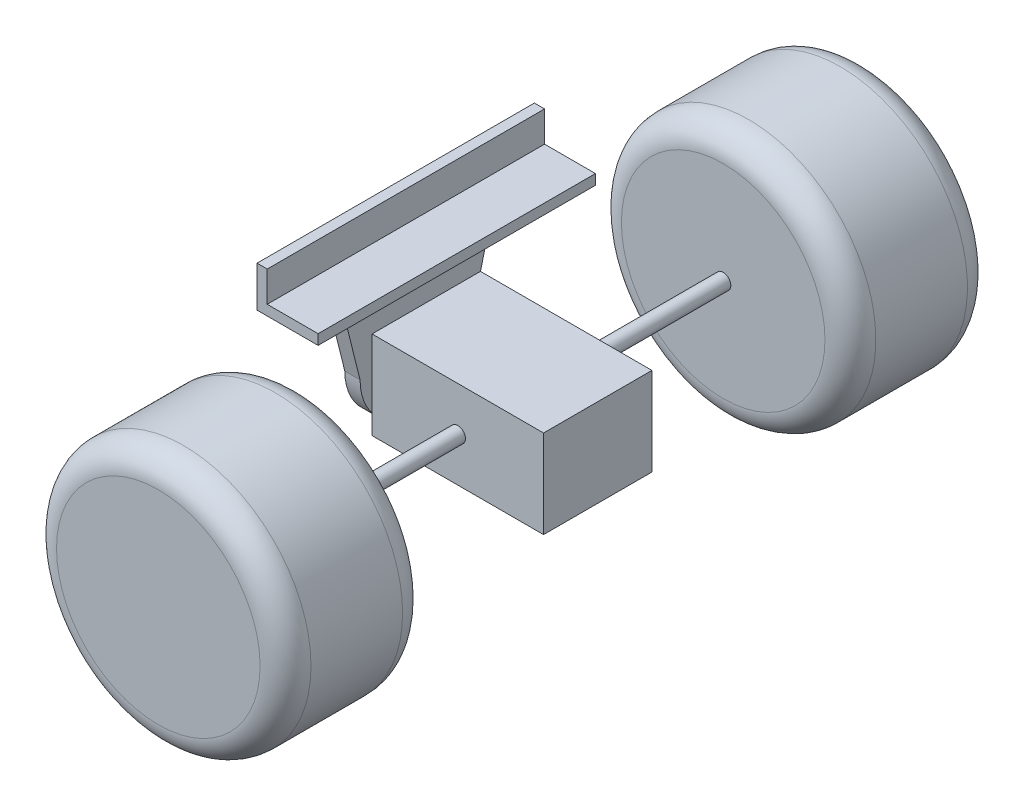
ISO-10303-21;
HEADER;
FILE_DESCRIPTION(('STEP AP214'),'2;1');
FILE_NAME('part.step','',(''),(''),'','','');
FILE_SCHEMA(('AUTOMOTIVE_DESIGN { 1 0 10303 214 1 1 1 1 }'));
ENDSEC;
DATA;
#1=APPLICATION_CONTEXT('core data for automotive mechanical design processes');
#2=APPLICATION_PROTOCOL_DEFINITION('international standard','automotive_design',2000,#1);
#3=PRODUCT_CONTEXT('',#1,'mechanical');
#4=PRODUCT('Part','Part','',(#3));
#5=PRODUCT_RELATED_PRODUCT_CATEGORY('part','',(#4));
#6=PRODUCT_DEFINITION_FORMATION('','',#4);
#7=PRODUCT_DEFINITION_CONTEXT('part definition',#1,'design');
#8=PRODUCT_DEFINITION('design','',#6,#7);
#9=PRODUCT_DEFINITION_SHAPE('','',#8);
#10=(LENGTH_UNIT() NAMED_UNIT(*) SI_UNIT(.MILLI.,.METRE.));
#11=(NAMED_UNIT(*) PLANE_ANGLE_UNIT() SI_UNIT($,.RADIAN.));
#12=(NAMED_UNIT(*) SI_UNIT($,.STERADIAN.) SOLID_ANGLE_UNIT());
#13=UNCERTAINTY_MEASURE_WITH_UNIT(LENGTH_MEASURE(1.E-05),#10,'distance_accuracy_value','');
#14=(GEOMETRIC_REPRESENTATION_CONTEXT(3) GLOBAL_UNCERTAINTY_ASSIGNED_CONTEXT((#13)) GLOBAL_UNIT_ASSIGNED_CONTEXT((#10,
#11,#12)) REPRESENTATION_CONTEXT('',''));
#15=CARTESIAN_POINT('',(0.,0.,0.));
#16=DIRECTION('',(0.,0.,1.));
#17=DIRECTION('',(1.,0.,0.));
#18=AXIS2_PLACEMENT_3D('',#15,#16,#17);
#19=CARTESIAN_POINT('',(0.,0.,41.5));
#20=DIRECTION('',(0.,0.,-1.));
#21=DIRECTION('',(-1.,0.,0.));
#22=AXIS2_PLACEMENT_3D('',#19,#20,#21);
#23=CYLINDRICAL_SURFACE('',#22,1.5);
#24=CARTESIAN_POINT('',(0.,0.,41.5));
#25=DIRECTION('',(0.,0.,1.));
#26=DIRECTION('',(1.,0.,0.));
#27=AXIS2_PLACEMENT_3D('',#24,#25,#26);
#28=CIRCLE('',#27,1.5);
#29=CARTESIAN_POINT('',(1.5,0.,41.5));
#30=VERTEX_POINT('',#29);
#31=EDGE_CURVE('E237',#30,#30,#28,.T.);
#32=ORIENTED_EDGE('',*,*,#31,.F.);
#33=EDGE_LOOP('',(#32));
#34=FACE_BOUND('',#33,.T.);
#35=CARTESIAN_POINT('',(0.,0.,10.65));
#36=DIRECTION('',(0.,0.,-1.));
#37=DIRECTION('',(-1.,0.,0.));
#38=AXIS2_PLACEMENT_3D('',#35,#36,#37);
#39=CIRCLE('',#38,1.5);
#40=CARTESIAN_POINT('',(-1.5,0.,10.65));
#41=VERTEX_POINT('',#40);
#42=EDGE_CURVE('E41',#41,#41,#39,.T.);
#43=ORIENTED_EDGE('',*,*,#42,.F.);
#44=EDGE_LOOP('',(#43));
#45=FACE_BOUND('',#44,.T.);
#46=ADVANCED_FACE('F37',(#34,#45),#23,.T.);
#47=CARTESIAN_POINT('',(0.,0.,69.5));
#48=DIRECTION('',(0.,0.,-1.));
#49=DIRECTION('',(-1.,0.,0.));
#50=AXIS2_PLACEMENT_3D('',#47,#48,#49);
#51=CYLINDRICAL_SURFACE('',#50,25.);
#52=CARTESIAN_POINT('',(0.,0.,46.5));
#53=DIRECTION('',(0.,0.,1.));
#54=DIRECTION('',(1.,0.,0.));
#55=AXIS2_PLACEMENT_3D('',#52,#53,#54);
#56=CIRCLE('',#55,25.);
#57=CARTESIAN_POINT('',(25.,0.,46.5));
#58=VERTEX_POINT('',#57);
#59=EDGE_CURVE('E246',#58,#58,#56,.T.);
#60=ORIENTED_EDGE('',*,*,#59,.T.);
#61=EDGE_LOOP('',(#60));
#62=FACE_BOUND('',#61,.T.);
#63=CARTESIAN_POINT('',(0.,0.,64.5));
#64=DIRECTION('',(0.,0.,1.));
#65=DIRECTION('',(1.,0.,0.));
#66=AXIS2_PLACEMENT_3D('',#63,#64,#65);
#67=CIRCLE('',#66,25.);
#68=CARTESIAN_POINT('',(25.,0.,64.5));
#69=VERTEX_POINT('',#68);
#70=EDGE_CURVE('E240',#69,#69,#67,.F.);
#71=ORIENTED_EDGE('',*,*,#70,.T.);
#72=EDGE_LOOP('',(#71));
#73=FACE_BOUND('',#72,.T.);
#74=ADVANCED_FACE('F298',(#62,#73),#51,.T.);
#75=CARTESIAN_POINT('',(0.,0.,69.5));
#76=DIRECTION('',(0.,0.,1.));
#77=DIRECTION('',(1.,0.,0.));
#78=AXIS2_PLACEMENT_3D('',#75,#76,#77);
#79=PLANE('',#78);
#80=CARTESIAN_POINT('',(0.,0.,69.5));
#81=DIRECTION('',(0.,0.,1.));
#82=DIRECTION('',(1.,0.,0.));
#83=AXIS2_PLACEMENT_3D('',#80,#81,#82);
#84=CIRCLE('',#83,20.);
#85=CARTESIAN_POINT('',(20.,0.,69.5));
#86=VERTEX_POINT('',#85);
#87=EDGE_CURVE('E252',#86,#86,#84,.T.);
#88=ORIENTED_EDGE('',*,*,#87,.T.);
#89=EDGE_LOOP('',(#88));
#90=FACE_BOUND('',#89,.T.);
#91=ADVANCED_FACE('F304',(#90),#79,.T.);
#92=CARTESIAN_POINT('',(0.,0.,41.5));
#93=DIRECTION('',(0.,0.,1.));
#94=DIRECTION('',(1.,0.,0.));
#95=AXIS2_PLACEMENT_3D('',#92,#93,#94);
#96=PLANE('',#95);
#97=CARTESIAN_POINT('',(0.,0.,41.5));
#98=DIRECTION('',(0.,0.,1.));
#99=DIRECTION('',(1.,0.,0.));
#100=AXIS2_PLACEMENT_3D('',#97,#98,#99);
#101=CIRCLE('',#100,20.);
#102=CARTESIAN_POINT('',(20.,0.,41.5));
#103=VERTEX_POINT('',#102);
#104=EDGE_CURVE('E249',#103,#103,#101,.F.);
#105=ORIENTED_EDGE('',*,*,#104,.T.);
#106=EDGE_LOOP('',(#105));
#107=FACE_BOUND('',#106,.T.);
#108=ORIENTED_EDGE('',*,*,#31,.T.);
#109=EDGE_LOOP('',(#108));
#110=FACE_BOUND('',#109,.T.);
#111=ADVANCED_FACE('F336',(#107,#110),#96,.F.);
#112=CARTESIAN_POINT('',(0.,0.,46.5));
#113=DIRECTION('',(0.,0.,1.));
#114=DIRECTION('',(1.,0.,0.));
#115=AXIS2_PLACEMENT_3D('',#112,#113,#114);
#116=TOROIDAL_SURFACE('',#115,20.,5.);
#117=ORIENTED_EDGE('',*,*,#104,.F.);
#118=EDGE_LOOP('',(#117));
#119=FACE_BOUND('',#118,.T.);
#120=ORIENTED_EDGE('',*,*,#59,.F.);
#121=EDGE_LOOP('',(#120));
#122=FACE_BOUND('',#121,.T.);
#123=ADVANCED_FACE('F339',(#119,#122),#116,.T.);
#124=CARTESIAN_POINT('',(0.,0.,64.5));
#125=DIRECTION('',(0.,0.,1.));
#126=DIRECTION('',(1.,0.,0.));
#127=AXIS2_PLACEMENT_3D('',#124,#125,#126);
#128=TOROIDAL_SURFACE('',#127,20.,5.);
#129=ORIENTED_EDGE('',*,*,#70,.F.);
#130=EDGE_LOOP('',(#129));
#131=FACE_BOUND('',#130,.T.);
#132=ORIENTED_EDGE('',*,*,#87,.F.);
#133=EDGE_LOOP('',(#132));
#134=FACE_BOUND('',#133,.T.);
#135=ADVANCED_FACE('F295',(#131,#134),#128,.T.);
#136=CARTESIAN_POINT('',(16.85,-8.65,10.65));
#137=DIRECTION('',(-1.,0.,0.));
#138=DIRECTION('',(0.,0.,1.));
#139=AXIS2_PLACEMENT_3D('',#136,#137,#138);
#140=PLANE('',#139);
#141=DIRECTION('',(0.,1.,0.));
#142=VECTOR('',#141,1.);
#143=CARTESIAN_POINT('',(16.85,-8.65,-10.65));
#144=LINE('',#143,#142);
#145=CARTESIAN_POINT('',(16.85,-8.65,-10.65));
#146=VERTEX_POINT('',#145);
#147=CARTESIAN_POINT('',(16.85,8.65,-10.65));
#148=VERTEX_POINT('',#147);
#149=EDGE_CURVE('E214',#146,#148,#144,.T.);
#150=ORIENTED_EDGE('',*,*,#149,.T.);
#151=DIRECTION('',(0.,0.,-1.));
#152=VECTOR('',#151,1.);
#153=CARTESIAN_POINT('',(16.85,8.65,10.65));
#154=LINE('',#153,#152);
#155=CARTESIAN_POINT('',(16.85,8.65,10.65));
#156=VERTEX_POINT('',#155);
#157=EDGE_CURVE('E234',#156,#148,#154,.T.);
#158=ORIENTED_EDGE('',*,*,#157,.F.);
#159=DIRECTION('',(0.,1.,0.));
#160=VECTOR('',#159,1.);
#161=CARTESIAN_POINT('',(16.85,-8.65,10.65));
#162=LINE('',#161,#160);
#163=CARTESIAN_POINT('',(16.85,-8.65,10.65));
#164=VERTEX_POINT('',#163);
#165=EDGE_CURVE('E216',#164,#156,#162,.T.);
#166=ORIENTED_EDGE('',*,*,#165,.F.);
#167=DIRECTION('',(0.,0.,-1.));
#168=VECTOR('',#167,1.);
#169=CARTESIAN_POINT('',(16.85,-8.65,10.65));
#170=LINE('',#169,#168);
#171=EDGE_CURVE('E222',#164,#146,#170,.T.);
#172=ORIENTED_EDGE('',*,*,#171,.T.);
#173=EDGE_LOOP('',(#150,#158,#166,#172));
#174=FACE_BOUND('',#173,.T.);
#175=ADVANCED_FACE('F281',(#174),#140,.F.);
#176=CARTESIAN_POINT('',(-16.85,8.65,10.65));
#177=DIRECTION('',(0.,-1.,0.));
#178=DIRECTION('',(0.,0.,-1.));
#179=AXIS2_PLACEMENT_3D('',#176,#177,#178);
#180=PLANE('',#179);
#181=DIRECTION('',(-1.,0.,0.));
#182=VECTOR('',#181,1.);
#183=CARTESIAN_POINT('',(-16.85,8.65,-10.65));
#184=LINE('',#183,#182);
#185=CARTESIAN_POINT('',(-16.85,8.65,-10.65));
#186=VERTEX_POINT('',#185);
#187=EDGE_CURVE('E225',#148,#186,#184,.T.);
#188=ORIENTED_EDGE('',*,*,#187,.T.);
#189=DIRECTION('',(0.,0.,-1.));
#190=VECTOR('',#189,1.);
#191=CARTESIAN_POINT('',(-16.85,8.65,10.65));
#192=LINE('',#191,#190);
#193=CARTESIAN_POINT('',(-16.85,8.65,10.65));
#194=VERTEX_POINT('',#193);
#195=EDGE_CURVE('E232',#194,#186,#192,.T.);
#196=ORIENTED_EDGE('',*,*,#195,.F.);
#197=DIRECTION('',(-1.,0.,0.));
#198=VECTOR('',#197,1.);
#199=CARTESIAN_POINT('',(-16.85,8.65,10.65));
#200=LINE('',#199,#198);
#201=EDGE_CURVE('E87',#156,#194,#200,.T.);
#202=ORIENTED_EDGE('',*,*,#201,.F.);
#203=ORIENTED_EDGE('',*,*,#157,.T.);
#204=EDGE_LOOP('',(#188,#196,#202,#203));
#205=FACE_BOUND('',#204,.T.);
#206=ADVANCED_FACE('F286',(#205),#180,.F.);
#207=CARTESIAN_POINT('',(-16.85,-8.65,10.65));
#208=DIRECTION('',(1.,0.,0.));
#209=DIRECTION('',(0.,0.,-1.));
#210=AXIS2_PLACEMENT_3D('',#207,#208,#209);
#211=PLANE('',#210);
#212=CARTESIAN_POINT('',(-16.85,0.,0.));
#213=DIRECTION('',(-1.,0.,0.));
#214=DIRECTION('',(0.,0.,1.));
#215=AXIS2_PLACEMENT_3D('',#212,#213,#214);
#216=CIRCLE('',#215,5.);
#217=CARTESIAN_POINT('',(-16.85,0.,5.));
#218=VERTEX_POINT('',#217);
#219=EDGE_CURVE('E11',#218,#218,#216,.T.);
#220=ORIENTED_EDGE('',*,*,#219,.F.);
#221=EDGE_LOOP('',(#220));
#222=FACE_BOUND('',#221,.T.);
#223=DIRECTION('',(0.,-1.,0.));
#224=VECTOR('',#223,1.);
#225=CARTESIAN_POINT('',(-16.85,-8.65,-10.65));
#226=LINE('',#225,#224);
#227=CARTESIAN_POINT('',(-16.85,-8.65,-10.65));
#228=VERTEX_POINT('',#227);
#229=EDGE_CURVE('E73',#186,#228,#226,.T.);
#230=ORIENTED_EDGE('',*,*,#229,.T.);
#231=DIRECTION('',(0.,0.,-1.));
#232=VECTOR('',#231,1.);
#233=CARTESIAN_POINT('',(-16.85,-8.65,10.65));
#234=LINE('',#233,#232);
#235=CARTESIAN_POINT('',(-16.85,-8.65,10.65));
#236=VERTEX_POINT('',#235);
#237=EDGE_CURVE('E230',#236,#228,#234,.T.);
#238=ORIENTED_EDGE('',*,*,#237,.F.);
#239=DIRECTION('',(0.,-1.,0.));
#240=VECTOR('',#239,1.);
#241=CARTESIAN_POINT('',(-16.85,-8.65,10.65));
#242=LINE('',#241,#240);
#243=EDGE_CURVE('E219',#194,#236,#242,.T.);
#244=ORIENTED_EDGE('',*,*,#243,.F.);
#245=ORIENTED_EDGE('',*,*,#195,.T.);
#246=EDGE_LOOP('',(#230,#238,#244,#245));
#247=FACE_BOUND('',#246,.T.);
#248=ADVANCED_FACE('F285',(#222,#247),#211,.F.);
#249=CARTESIAN_POINT('',(-16.85,-8.65,10.65));
#250=DIRECTION('',(0.,1.,0.));
#251=DIRECTION('',(0.,0.,1.));
#252=AXIS2_PLACEMENT_3D('',#249,#250,#251);
#253=PLANE('',#252);
#254=DIRECTION('',(1.,0.,0.));
#255=VECTOR('',#254,1.);
#256=CARTESIAN_POINT('',(-16.85,-8.65,-10.65));
#257=LINE('',#256,#255);
#258=EDGE_CURVE('E79',#228,#146,#257,.T.);
#259=ORIENTED_EDGE('',*,*,#258,.T.);
#260=ORIENTED_EDGE('',*,*,#171,.F.);
#261=DIRECTION('',(1.,0.,0.));
#262=VECTOR('',#261,1.);
#263=CARTESIAN_POINT('',(-16.85,-8.65,10.65));
#264=LINE('',#263,#262);
#265=EDGE_CURVE('E55',#236,#164,#264,.T.);
#266=ORIENTED_EDGE('',*,*,#265,.F.);
#267=ORIENTED_EDGE('',*,*,#237,.T.);
#268=EDGE_LOOP('',(#259,#260,#266,#267));
#269=FACE_BOUND('',#268,.T.);
#270=ADVANCED_FACE('F283',(#269),#253,.F.);
#271=CARTESIAN_POINT('',(0.,0.,10.65));
#272=DIRECTION('',(0.,0.,-1.));
#273=DIRECTION('',(-1.,0.,0.));
#274=AXIS2_PLACEMENT_3D('',#271,#272,#273);
#275=PLANE('',#274);
#276=ORIENTED_EDGE('',*,*,#42,.T.);
#277=EDGE_LOOP('',(#276));
#278=FACE_BOUND('',#277,.T.);
#279=ORIENTED_EDGE('',*,*,#165,.T.);
#280=ORIENTED_EDGE('',*,*,#201,.T.);
#281=ORIENTED_EDGE('',*,*,#243,.T.);
#282=ORIENTED_EDGE('',*,*,#265,.T.);
#283=EDGE_LOOP('',(#279,#280,#281,#282));
#284=FACE_BOUND('',#283,.T.);
#285=ADVANCED_FACE('F276',(#278,#284),#275,.F.);
#286=CARTESIAN_POINT('',(0.,0.,-10.65));
#287=DIRECTION('',(0.,0.,-1.));
#288=DIRECTION('',(-1.,0.,0.));
#289=AXIS2_PLACEMENT_3D('',#286,#287,#288);
#290=PLANE('',#289);
#291=CARTESIAN_POINT('',(0.,0.,-10.65));
#292=DIRECTION('',(0.,0.,-1.));
#293=DIRECTION('',(-1.,0.,0.));
#294=AXIS2_PLACEMENT_3D('',#291,#292,#293);
#295=CIRCLE('',#294,1.5);
#296=CARTESIAN_POINT('',(-1.5,0.,-10.65));
#297=VERTEX_POINT('',#296);
#298=EDGE_CURVE('E236',#297,#297,#295,.T.);
#299=ORIENTED_EDGE('',*,*,#298,.F.);
#300=EDGE_LOOP('',(#299));
#301=FACE_BOUND('',#300,.T.);
#302=ORIENTED_EDGE('',*,*,#149,.F.);
#303=ORIENTED_EDGE('',*,*,#258,.F.);
#304=ORIENTED_EDGE('',*,*,#229,.F.);
#305=ORIENTED_EDGE('',*,*,#187,.F.);
#306=EDGE_LOOP('',(#302,#303,#304,#305));
#307=FACE_BOUND('',#306,.T.);
#308=ADVANCED_FACE('F272',(#301,#307),#290,.T.);
#309=CARTESIAN_POINT('',(0.,0.,-69.5));
#310=DIRECTION('',(0.,0.,-1.));
#311=DIRECTION('',(1.,0.,0.));
#312=AXIS2_PLACEMENT_3D('',#309,#310,#311);
#313=PLANE('',#312);
#314=CARTESIAN_POINT('',(0.,0.,-69.5));
#315=DIRECTION('',(0.,0.,-1.));
#316=DIRECTION('',(-1.,0.,0.));
#317=AXIS2_PLACEMENT_3D('',#314,#315,#316);
#318=CIRCLE('',#317,20.);
#319=CARTESIAN_POINT('',(-20.,0.,-69.5));
#320=VERTEX_POINT('',#319);
#321=EDGE_CURVE('E264',#320,#320,#318,.T.);
#322=ORIENTED_EDGE('',*,*,#321,.T.);
#323=EDGE_LOOP('',(#322));
#324=FACE_BOUND('',#323,.T.);
#325=ADVANCED_FACE('F275',(#324),#313,.T.);
#326=CARTESIAN_POINT('',(0.,0.,-64.5));
#327=DIRECTION('',(0.,0.,-1.));
#328=DIRECTION('',(-1.,0.,0.));
#329=AXIS2_PLACEMENT_3D('',#326,#327,#328);
#330=TOROIDAL_SURFACE('',#329,20.,5.);
#331=ORIENTED_EDGE('',*,*,#321,.F.);
#332=EDGE_LOOP('',(#331));
#333=FACE_BOUND('',#332,.T.);
#334=CARTESIAN_POINT('',(0.,0.,-64.5));
#335=DIRECTION('',(0.,0.,-1.));
#336=DIRECTION('',(-1.,0.,0.));
#337=AXIS2_PLACEMENT_3D('',#334,#335,#336);
#338=CIRCLE('',#337,25.);
#339=CARTESIAN_POINT('',(-25.,0.,-64.5));
#340=VERTEX_POINT('',#339);
#341=EDGE_CURVE('E258',#340,#340,#338,.F.);
#342=ORIENTED_EDGE('',*,*,#341,.F.);
#343=EDGE_LOOP('',(#342));
#344=FACE_BOUND('',#343,.T.);
#345=ADVANCED_FACE('F39',(#333,#344),#330,.T.);
#346=CARTESIAN_POINT('',(0.,0.,-69.5));
#347=DIRECTION('',(0.,0.,1.));
#348=DIRECTION('',(1.,0.,0.));
#349=AXIS2_PLACEMENT_3D('',#346,#347,#348);
#350=CYLINDRICAL_SURFACE('',#349,25.);
#351=CARTESIAN_POINT('',(0.,0.,-46.5));
#352=DIRECTION('',(0.,0.,-1.));
#353=DIRECTION('',(-1.,0.,0.));
#354=AXIS2_PLACEMENT_3D('',#351,#352,#353);
#355=CIRCLE('',#354,25.);
#356=CARTESIAN_POINT('',(-25.,0.,-46.5));
#357=VERTEX_POINT('',#356);
#358=EDGE_CURVE('E261',#357,#357,#355,.T.);
#359=ORIENTED_EDGE('',*,*,#358,.T.);
#360=EDGE_LOOP('',(#359));
#361=FACE_BOUND('',#360,.T.);
#362=ORIENTED_EDGE('',*,*,#341,.T.);
#363=EDGE_LOOP('',(#362));
#364=FACE_BOUND('',#363,.T.);
#365=ADVANCED_FACE('F326',(#361,#364),#350,.T.);
#366=CARTESIAN_POINT('',(0.,0.,-46.5));
#367=DIRECTION('',(0.,0.,-1.));
#368=DIRECTION('',(-1.,0.,0.));
#369=AXIS2_PLACEMENT_3D('',#366,#367,#368);
#370=TOROIDAL_SURFACE('',#369,20.,5.);
#371=ORIENTED_EDGE('',*,*,#358,.F.);
#372=EDGE_LOOP('',(#371));
#373=FACE_BOUND('',#372,.T.);
#374=CARTESIAN_POINT('',(0.,0.,-41.5));
#375=DIRECTION('',(0.,0.,-1.));
#376=DIRECTION('',(-1.,0.,0.));
#377=AXIS2_PLACEMENT_3D('',#374,#375,#376);
#378=CIRCLE('',#377,20.);
#379=CARTESIAN_POINT('',(-20.,0.,-41.5));
#380=VERTEX_POINT('',#379);
#381=EDGE_CURVE('E255',#380,#380,#378,.F.);
#382=ORIENTED_EDGE('',*,*,#381,.F.);
#383=EDGE_LOOP('',(#382));
#384=FACE_BOUND('',#383,.T.);
#385=ADVANCED_FACE('F320',(#373,#384),#370,.T.);
#386=CARTESIAN_POINT('',(0.,0.,-41.5));
#387=DIRECTION('',(0.,0.,-1.));
#388=DIRECTION('',(1.,0.,0.));
#389=AXIS2_PLACEMENT_3D('',#386,#387,#388);
#390=PLANE('',#389);
#391=ORIENTED_EDGE('',*,*,#381,.T.);
#392=EDGE_LOOP('',(#391));
#393=FACE_BOUND('',#392,.T.);
#394=CARTESIAN_POINT('',(0.,0.,-41.5));
#395=DIRECTION('',(0.,0.,1.));
#396=DIRECTION('',(1.,0.,0.));
#397=AXIS2_PLACEMENT_3D('',#394,#395,#396);
#398=CIRCLE('',#397,1.5);
#399=CARTESIAN_POINT('',(1.5,0.,-41.5));
#400=VERTEX_POINT('',#399);
#401=EDGE_CURVE('E241',#400,#400,#398,.T.);
#402=ORIENTED_EDGE('',*,*,#401,.F.);
#403=EDGE_LOOP('',(#402));
#404=FACE_BOUND('',#403,.T.);
#405=ADVANCED_FACE('F312',(#393,#404),#390,.F.);
#406=ORIENTED_EDGE('',*,*,#298,.T.);
#407=EDGE_LOOP('',(#406));
#408=FACE_BOUND('',#407,.T.);
#409=ORIENTED_EDGE('',*,*,#401,.T.);
#410=EDGE_LOOP('',(#409));
#411=FACE_BOUND('',#410,.T.);
#412=ADVANCED_FACE('F269',(#408,#411),#23,.T.);
#413=CARTESIAN_POINT('',(-18.85,0.,0.));
#414=DIRECTION('',(1.,0.,0.));
#415=DIRECTION('',(0.,0.,-1.));
#416=AXIS2_PLACEMENT_3D('',#413,#414,#415);
#417=CYLINDRICAL_SURFACE('',#416,5.);
#418=CARTESIAN_POINT('',(-18.85,0.,0.));
#419=DIRECTION('',(-1.,0.,0.));
#420=DIRECTION('',(0.,0.,1.));
#421=AXIS2_PLACEMENT_3D('',#418,#419,#420);
#422=CIRCLE('',#421,5.);
#423=CARTESIAN_POINT('',(-18.85,0.,5.));
#424=VERTEX_POINT('',#423);
#425=EDGE_CURVE('E212',#424,#424,#422,.T.);
#426=ORIENTED_EDGE('',*,*,#425,.F.);
#427=EDGE_LOOP('',(#426));
#428=FACE_BOUND('',#427,.T.);
#429=ORIENTED_EDGE('',*,*,#219,.T.);
#430=EDGE_LOOP('',(#429));
#431=FACE_BOUND('',#430,.T.);
#432=ADVANCED_FACE('F311',(#428,#431),#417,.T.);
#433=CARTESIAN_POINT('',(-21.85,-2.58823529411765,-10.3529411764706));
#434=DIRECTION('',(0.,0.242535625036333,0.970142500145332));
#435=DIRECTION('',(0.,-0.970142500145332,0.242535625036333));
#436=AXIS2_PLACEMENT_3D('',#433,#434,#435);
#437=PLANE('',#436);
#438=DIRECTION('',(0.,-0.970142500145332,0.242535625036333));
#439=VECTOR('',#438,1.);
#440=CARTESIAN_POINT('',(-18.85,-2.58823529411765,-10.3529411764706));
#441=LINE('',#440,#439);
#442=CARTESIAN_POINT('',(-18.85,18.,-15.5));
#443=VERTEX_POINT('',#442);
#444=CARTESIAN_POINT('',(-18.85,0.,-11.));
#445=VERTEX_POINT('',#444);
#446=EDGE_CURVE('E179',#443,#445,#441,.T.);
#447=ORIENTED_EDGE('',*,*,#446,.T.);
#448=DIRECTION('',(1.,0.,0.));
#449=VECTOR('',#448,1.);
#450=CARTESIAN_POINT('',(-21.85,0.,-11.));
#451=LINE('',#450,#449);
#452=CARTESIAN_POINT('',(-21.85,0.,-11.));
#453=VERTEX_POINT('',#452);
#454=EDGE_CURVE('E206',#453,#445,#451,.T.);
#455=ORIENTED_EDGE('',*,*,#454,.F.);
#456=DIRECTION('',(0.,-0.970142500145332,0.242535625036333));
#457=VECTOR('',#456,1.);
#458=CARTESIAN_POINT('',(-21.85,-2.58823529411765,-10.3529411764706));
#459=LINE('',#458,#457);
#460=CARTESIAN_POINT('',(-21.85,18.,-15.5));
#461=VERTEX_POINT('',#460);
#462=EDGE_CURVE('E188',#461,#453,#459,.T.);
#463=ORIENTED_EDGE('',*,*,#462,.F.);
#464=DIRECTION('',(1.,0.,0.));
#465=VECTOR('',#464,1.);
#466=CARTESIAN_POINT('',(-21.85,18.,-15.5));
#467=LINE('',#466,#465);
#468=EDGE_CURVE('E209',#461,#443,#467,.T.);
#469=ORIENTED_EDGE('',*,*,#468,.T.);
#470=EDGE_LOOP('',(#447,#455,#463,#469));
#471=FACE_BOUND('',#470,.T.);
#472=ADVANCED_FACE('F317',(#471),#437,.F.);
#473=CARTESIAN_POINT('',(-21.85,0.,0.));
#474=DIRECTION('',(1.,0.,0.));
#475=DIRECTION('',(0.,0.,-1.));
#476=AXIS2_PLACEMENT_3D('',#473,#474,#475);
#477=CYLINDRICAL_SURFACE('',#476,11.);
#478=CARTESIAN_POINT('',(-18.85,0.,0.));
#479=DIRECTION('',(-1.,0.,0.));
#480=DIRECTION('',(0.,0.,1.));
#481=AXIS2_PLACEMENT_3D('',#478,#479,#480);
#482=CIRCLE('',#481,11.);
#483=CARTESIAN_POINT('',(-18.85,0.,11.));
#484=VERTEX_POINT('',#483);
#485=EDGE_CURVE('E197',#445,#484,#482,.T.);
#486=ORIENTED_EDGE('',*,*,#485,.T.);
#487=DIRECTION('',(1.,0.,0.));
#488=VECTOR('',#487,1.);
#489=CARTESIAN_POINT('',(-21.85,0.,11.));
#490=LINE('',#489,#488);
#491=CARTESIAN_POINT('',(-21.85,0.,11.));
#492=VERTEX_POINT('',#491);
#493=EDGE_CURVE('E203',#492,#484,#490,.T.);
#494=ORIENTED_EDGE('',*,*,#493,.F.);
#495=CARTESIAN_POINT('',(-21.85,0.,0.));
#496=DIRECTION('',(-1.,0.,0.));
#497=DIRECTION('',(0.,0.,1.));
#498=AXIS2_PLACEMENT_3D('',#495,#496,#497);
#499=CIRCLE('',#498,11.);
#500=EDGE_CURVE('E191',#453,#492,#499,.T.);
#501=ORIENTED_EDGE('',*,*,#500,.F.);
#502=ORIENTED_EDGE('',*,*,#454,.T.);
#503=EDGE_LOOP('',(#486,#494,#501,#502));
#504=FACE_BOUND('',#503,.T.);
#505=ADVANCED_FACE('F420',(#504),#477,.T.);
#506=CARTESIAN_POINT('',(-21.85,-2.58823529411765,10.3529411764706));
#507=DIRECTION('',(0.,0.242535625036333,-0.970142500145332));
#508=DIRECTION('',(0.,0.970142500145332,0.242535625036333));
#509=AXIS2_PLACEMENT_3D('',#506,#507,#508);
#510=PLANE('',#509);
#511=DIRECTION('',(0.,0.970142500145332,0.242535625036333));
#512=VECTOR('',#511,1.);
#513=CARTESIAN_POINT('',(-18.85,-2.58823529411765,10.3529411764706));
#514=LINE('',#513,#512);
#515=CARTESIAN_POINT('',(-18.85,18.,15.5));
#516=VERTEX_POINT('',#515);
#517=EDGE_CURVE('E189',#484,#516,#514,.T.);
#518=ORIENTED_EDGE('',*,*,#517,.T.);
#519=DIRECTION('',(1.,0.,0.));
#520=VECTOR('',#519,1.);
#521=CARTESIAN_POINT('',(-21.85,18.,15.5));
#522=LINE('',#521,#520);
#523=CARTESIAN_POINT('',(-21.85,18.,15.5));
#524=VERTEX_POINT('',#523);
#525=EDGE_CURVE('E194',#524,#516,#522,.T.);
#526=ORIENTED_EDGE('',*,*,#525,.F.);
#527=DIRECTION('',(0.,0.970142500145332,0.242535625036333));
#528=VECTOR('',#527,1.);
#529=CARTESIAN_POINT('',(-21.85,-2.58823529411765,10.3529411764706));
#530=LINE('',#529,#528);
#531=EDGE_CURVE('E193',#492,#524,#530,.T.);
#532=ORIENTED_EDGE('',*,*,#531,.F.);
#533=ORIENTED_EDGE('',*,*,#493,.T.);
#534=EDGE_LOOP('',(#518,#526,#532,#533));
#535=FACE_BOUND('',#534,.T.);
#536=ADVANCED_FACE('F425',(#535),#510,.F.);
#537=CARTESIAN_POINT('',(-21.85,0.,0.));
#538=DIRECTION('',(-1.,0.,0.));
#539=DIRECTION('',(0.,0.,1.));
#540=AXIS2_PLACEMENT_3D('',#537,#538,#539);
#541=PLANE('',#540);
#542=DIRECTION('',(0.,0.,-1.));
#543=VECTOR('',#542,1.);
#544=CARTESIAN_POINT('',(-21.85,18.,0.));
#545=LINE('',#544,#543);
#546=EDGE_CURVE('E185',#524,#461,#545,.T.);
#547=ORIENTED_EDGE('',*,*,#546,.T.);
#548=ORIENTED_EDGE('',*,*,#462,.T.);
#549=ORIENTED_EDGE('',*,*,#500,.T.);
#550=ORIENTED_EDGE('',*,*,#531,.T.);
#551=EDGE_LOOP('',(#547,#548,#549,#550));
#552=FACE_BOUND('',#551,.T.);
#553=ADVANCED_FACE('F442',(#552),#541,.T.);
#554=CARTESIAN_POINT('',(-18.85,0.,0.));
#555=DIRECTION('',(-1.,0.,0.));
#556=DIRECTION('',(0.,0.,1.));
#557=AXIS2_PLACEMENT_3D('',#554,#555,#556);
#558=PLANE('',#557);
#559=ORIENTED_EDGE('',*,*,#425,.T.);
#560=EDGE_LOOP('',(#559));
#561=FACE_BOUND('',#560,.T.);
#562=DIRECTION('',(0.,0.,-1.));
#563=VECTOR('',#562,1.);
#564=CARTESIAN_POINT('',(-18.85,18.,0.));
#565=LINE('',#564,#563);
#566=EDGE_CURVE('E176',#516,#443,#565,.T.);
#567=ORIENTED_EDGE('',*,*,#566,.F.);
#568=ORIENTED_EDGE('',*,*,#517,.F.);
#569=ORIENTED_EDGE('',*,*,#485,.F.);
#570=ORIENTED_EDGE('',*,*,#446,.F.);
#571=EDGE_LOOP('',(#567,#568,#569,#570));
#572=FACE_BOUND('',#571,.T.);
#573=ADVANCED_FACE('F453',(#561,#572),#558,.F.);
#574=CARTESIAN_POINT('',(0.,18.,27.25));
#575=DIRECTION('',(0.,1.,0.));
#576=DIRECTION('',(0.,0.,1.));
#577=AXIS2_PLACEMENT_3D('',#574,#575,#576);
#578=PLANE('',#577);
#579=DIRECTION('',(1.,0.,0.));
#580=VECTOR('',#579,1.);
#581=CARTESIAN_POINT('',(0.,18.,-27.25));
#582=LINE('',#581,#580);
#583=CARTESIAN_POINT('',(-22.85,18.,-27.25));
#584=VERTEX_POINT('',#583);
#585=CARTESIAN_POINT('',(-10.85,18.,-27.25));
#586=VERTEX_POINT('',#585);
#587=EDGE_CURVE('E175',#584,#586,#582,.T.);
#588=ORIENTED_EDGE('',*,*,#587,.T.);
#589=DIRECTION('',(0.,0.,-1.));
#590=VECTOR('',#589,1.);
#591=CARTESIAN_POINT('',(-10.85,18.,27.25));
#592=LINE('',#591,#590);
#593=CARTESIAN_POINT('',(-10.85,18.,27.25));
#594=VERTEX_POINT('',#593);
#595=EDGE_CURVE('E155',#594,#586,#592,.T.);
#596=ORIENTED_EDGE('',*,*,#595,.F.);
#597=DIRECTION('',(1.,0.,0.));
#598=VECTOR('',#597,1.);
#599=CARTESIAN_POINT('',(0.,18.,27.25));
#600=LINE('',#599,#598);
#601=CARTESIAN_POINT('',(-22.85,18.,27.25));
#602=VERTEX_POINT('',#601);
#603=EDGE_CURVE('E162',#602,#594,#600,.T.);
#604=ORIENTED_EDGE('',*,*,#603,.F.);
#605=DIRECTION('',(0.,0.,-1.));
#606=VECTOR('',#605,1.);
#607=CARTESIAN_POINT('',(-22.85,18.,27.25));
#608=LINE('',#607,#606);
#609=EDGE_CURVE('E555',#602,#584,#608,.T.);
#610=ORIENTED_EDGE('',*,*,#609,.T.);
#611=EDGE_LOOP('',(#588,#596,#604,#610));
#612=FACE_BOUND('',#611,.T.);
#613=ORIENTED_EDGE('',*,*,#525,.T.);
#614=ORIENTED_EDGE('',*,*,#566,.T.);
#615=ORIENTED_EDGE('',*,*,#468,.F.);
#616=ORIENTED_EDGE('',*,*,#546,.F.);
#617=EDGE_LOOP('',(#613,#614,#615,#616));
#618=FACE_BOUND('',#617,.T.);
#619=ADVANCED_FACE('F172',(#612,#618),#578,.F.);
#620=CARTESIAN_POINT('',(-10.85,0.,27.25));
#621=DIRECTION('',(-1.,0.,0.));
#622=DIRECTION('',(0.,0.,1.));
#623=AXIS2_PLACEMENT_3D('',#620,#621,#622);
#624=PLANE('',#623);
#625=DIRECTION('',(0.,1.,0.));
#626=VECTOR('',#625,1.);
#627=CARTESIAN_POINT('',(-10.85,0.,-27.25));
#628=LINE('',#627,#626);
#629=CARTESIAN_POINT('',(-10.85,20.,-27.25));
#630=VERTEX_POINT('',#629);
#631=EDGE_CURVE('E553',#586,#630,#628,.T.);
#632=ORIENTED_EDGE('',*,*,#631,.T.);
#633=DIRECTION('',(0.,0.,-1.));
#634=VECTOR('',#633,1.);
#635=CARTESIAN_POINT('',(-10.85,20.,27.25));
#636=LINE('',#635,#634);
#637=CARTESIAN_POINT('',(-10.85,20.,27.25));
#638=VERTEX_POINT('',#637);
#639=EDGE_CURVE('E157',#638,#630,#636,.T.);
#640=ORIENTED_EDGE('',*,*,#639,.F.);
#641=DIRECTION('',(0.,1.,0.));
#642=VECTOR('',#641,1.);
#643=CARTESIAN_POINT('',(-10.85,0.,27.25));
#644=LINE('',#643,#642);
#645=EDGE_CURVE('E150',#594,#638,#644,.T.);
#646=ORIENTED_EDGE('',*,*,#645,.F.);
#647=ORIENTED_EDGE('',*,*,#595,.T.);
#648=EDGE_LOOP('',(#632,#640,#646,#647));
#649=FACE_BOUND('',#648,.T.);
#650=ADVANCED_FACE('F153',(#649),#624,.F.);
#651=CARTESIAN_POINT('',(0.,20.,27.25));
#652=DIRECTION('',(0.,1.,0.));
#653=DIRECTION('',(0.,0.,1.));
#654=AXIS2_PLACEMENT_3D('',#651,#652,#653);
#655=PLANE('',#654);
#656=DIRECTION('',(1.,0.,0.));
#657=VECTOR('',#656,1.);
#658=CARTESIAN_POINT('',(0.,20.,-27.25));
#659=LINE('',#658,#657);
#660=CARTESIAN_POINT('',(-20.85,20.,-27.25));
#661=VERTEX_POINT('',#660);
#662=EDGE_CURVE('E574',#661,#630,#659,.T.);
#663=ORIENTED_EDGE('',*,*,#662,.F.);
#664=DIRECTION('',(0.,0.,-1.));
#665=VECTOR('',#664,1.);
#666=CARTESIAN_POINT('',(-20.85,20.,27.25));
#667=LINE('',#666,#665);
#668=CARTESIAN_POINT('',(-20.85,20.,27.25));
#669=VERTEX_POINT('',#668);
#670=EDGE_CURVE('E181',#669,#661,#667,.T.);
#671=ORIENTED_EDGE('',*,*,#670,.F.);
#672=DIRECTION('',(1.,0.,0.));
#673=VECTOR('',#672,1.);
#674=CARTESIAN_POINT('',(0.,20.,27.25));
#675=LINE('',#674,#673);
#676=EDGE_CURVE('E161',#669,#638,#675,.T.);
#677=ORIENTED_EDGE('',*,*,#676,.T.);
#678=ORIENTED_EDGE('',*,*,#639,.T.);
#679=EDGE_LOOP('',(#663,#671,#677,#678));
#680=FACE_BOUND('',#679,.T.);
#681=ADVANCED_FACE('F484',(#680),#655,.T.);
#682=CARTESIAN_POINT('',(-20.85,0.,27.25));
#683=DIRECTION('',(-1.,0.,0.));
#684=DIRECTION('',(0.,0.,1.));
#685=AXIS2_PLACEMENT_3D('',#682,#683,#684);
#686=PLANE('',#685);
#687=DIRECTION('',(0.,1.,0.));
#688=VECTOR('',#687,1.);
#689=CARTESIAN_POINT('',(-20.85,0.,-27.25));
#690=LINE('',#689,#688);
#691=CARTESIAN_POINT('',(-20.85,26.,-27.25));
#692=VERTEX_POINT('',#691);
#693=EDGE_CURVE('E561',#661,#692,#690,.T.);
#694=ORIENTED_EDGE('',*,*,#693,.T.);
#695=DIRECTION('',(0.,0.,-1.));
#696=VECTOR('',#695,1.);
#697=CARTESIAN_POINT('',(-20.85,26.,27.25));
#698=LINE('',#697,#696);
#699=CARTESIAN_POINT('',(-20.85,26.,27.25));
#700=VERTEX_POINT('',#699);
#701=EDGE_CURVE('E567',#700,#692,#698,.T.);
#702=ORIENTED_EDGE('',*,*,#701,.F.);
#703=DIRECTION('',(0.,1.,0.));
#704=VECTOR('',#703,1.);
#705=CARTESIAN_POINT('',(-20.85,0.,27.25));
#706=LINE('',#705,#704);
#707=EDGE_CURVE('E572',#669,#700,#706,.T.);
#708=ORIENTED_EDGE('',*,*,#707,.F.);
#709=ORIENTED_EDGE('',*,*,#670,.T.);
#710=EDGE_LOOP('',(#694,#702,#708,#709));
#711=FACE_BOUND('',#710,.T.);
#712=ADVANCED_FACE('F493',(#711),#686,.F.);
#713=CARTESIAN_POINT('',(0.,26.,27.25));
#714=DIRECTION('',(0.,-1.,0.));
#715=DIRECTION('',(0.,0.,-1.));
#716=AXIS2_PLACEMENT_3D('',#713,#714,#715);
#717=PLANE('',#716);
#718=DIRECTION('',(-1.,0.,0.));
#719=VECTOR('',#718,1.);
#720=CARTESIAN_POINT('',(0.,26.,-27.25));
#721=LINE('',#720,#719);
#722=CARTESIAN_POINT('',(-22.85,26.,-27.25));
#723=VERTEX_POINT('',#722);
#724=EDGE_CURVE('E559',#692,#723,#721,.T.);
#725=ORIENTED_EDGE('',*,*,#724,.T.);
#726=DIRECTION('',(0.,0.,-1.));
#727=VECTOR('',#726,1.);
#728=CARTESIAN_POINT('',(-22.85,26.,27.25));
#729=LINE('',#728,#727);
#730=CARTESIAN_POINT('',(-22.85,26.,27.25));
#731=VERTEX_POINT('',#730);
#732=EDGE_CURVE('E557',#731,#723,#729,.T.);
#733=ORIENTED_EDGE('',*,*,#732,.F.);
#734=DIRECTION('',(-1.,0.,0.));
#735=VECTOR('',#734,1.);
#736=CARTESIAN_POINT('',(0.,26.,27.25));
#737=LINE('',#736,#735);
#738=EDGE_CURVE('E579',#700,#731,#737,.T.);
#739=ORIENTED_EDGE('',*,*,#738,.F.);
#740=ORIENTED_EDGE('',*,*,#701,.T.);
#741=EDGE_LOOP('',(#725,#733,#739,#740));
#742=FACE_BOUND('',#741,.T.);
#743=ADVANCED_FACE('F503',(#742),#717,.F.);
#744=CARTESIAN_POINT('',(-22.85,0.,27.25));
#745=DIRECTION('',(-1.,0.,0.));
#746=DIRECTION('',(0.,0.,1.));
#747=AXIS2_PLACEMENT_3D('',#744,#745,#746);
#748=PLANE('',#747);
#749=DIRECTION('',(0.,1.,0.));
#750=VECTOR('',#749,1.);
#751=CARTESIAN_POINT('',(-22.85,0.,-27.25));
#752=LINE('',#751,#750);
#753=EDGE_CURVE('E170',#584,#723,#752,.T.);
#754=ORIENTED_EDGE('',*,*,#753,.F.);
#755=ORIENTED_EDGE('',*,*,#609,.F.);
#756=DIRECTION('',(0.,1.,0.));
#757=VECTOR('',#756,1.);
#758=CARTESIAN_POINT('',(-22.85,0.,27.25));
#759=LINE('',#758,#757);
#760=EDGE_CURVE('E168',#602,#731,#759,.T.);
#761=ORIENTED_EDGE('',*,*,#760,.T.);
#762=ORIENTED_EDGE('',*,*,#732,.T.);
#763=EDGE_LOOP('',(#754,#755,#761,#762));
#764=FACE_BOUND('',#763,.T.);
#765=ADVANCED_FACE('F513',(#764),#748,.T.);
#766=CARTESIAN_POINT('',(0.,0.,27.25));
#767=DIRECTION('',(0.,0.,1.));
#768=DIRECTION('',(1.,0.,0.));
#769=AXIS2_PLACEMENT_3D('',#766,#767,#768);
#770=PLANE('',#769);
#771=ORIENTED_EDGE('',*,*,#603,.T.);
#772=ORIENTED_EDGE('',*,*,#645,.T.);
#773=ORIENTED_EDGE('',*,*,#676,.F.);
#774=ORIENTED_EDGE('',*,*,#707,.T.);
#775=ORIENTED_EDGE('',*,*,#738,.T.);
#776=ORIENTED_EDGE('',*,*,#760,.F.);
#777=EDGE_LOOP('',(#771,#772,#773,#774,#775,#776));
#778=FACE_BOUND('',#777,.T.);
#779=ADVANCED_FACE('F166',(#778),#770,.T.);
#780=CARTESIAN_POINT('',(0.,0.,-27.25));
#781=DIRECTION('',(0.,0.,1.));
#782=DIRECTION('',(1.,0.,0.));
#783=AXIS2_PLACEMENT_3D('',#780,#781,#782);
#784=PLANE('',#783);
#785=ORIENTED_EDGE('',*,*,#587,.F.);
#786=ORIENTED_EDGE('',*,*,#753,.T.);
#787=ORIENTED_EDGE('',*,*,#724,.F.);
#788=ORIENTED_EDGE('',*,*,#693,.F.);
#789=ORIENTED_EDGE('',*,*,#662,.T.);
#790=ORIENTED_EDGE('',*,*,#631,.F.);
#791=EDGE_LOOP('',(#785,#786,#787,#788,#789,#790));
#792=FACE_BOUND('',#791,.T.);
#793=ADVANCED_FACE('F533',(#792),#784,.F.);
#794=CLOSED_SHELL('',(#46,#74,#91,#111,#123,#135,#175,#206,#248,#270,#285,#308,#325,#345,#365,
#385,#405,#412,#432,#472,#505,#536,#553,#573,#619,#650,#681,#712,#743,#765,#779,#793));
#795=MANIFOLD_SOLID_BREP('B2',#794);
#796=ADVANCED_BREP_SHAPE_REPRESENTATION('',(#18,#795),#14);
#797=SHAPE_DEFINITION_REPRESENTATION(#9,#796);
ENDSEC;
END-ISO-10303-21;
